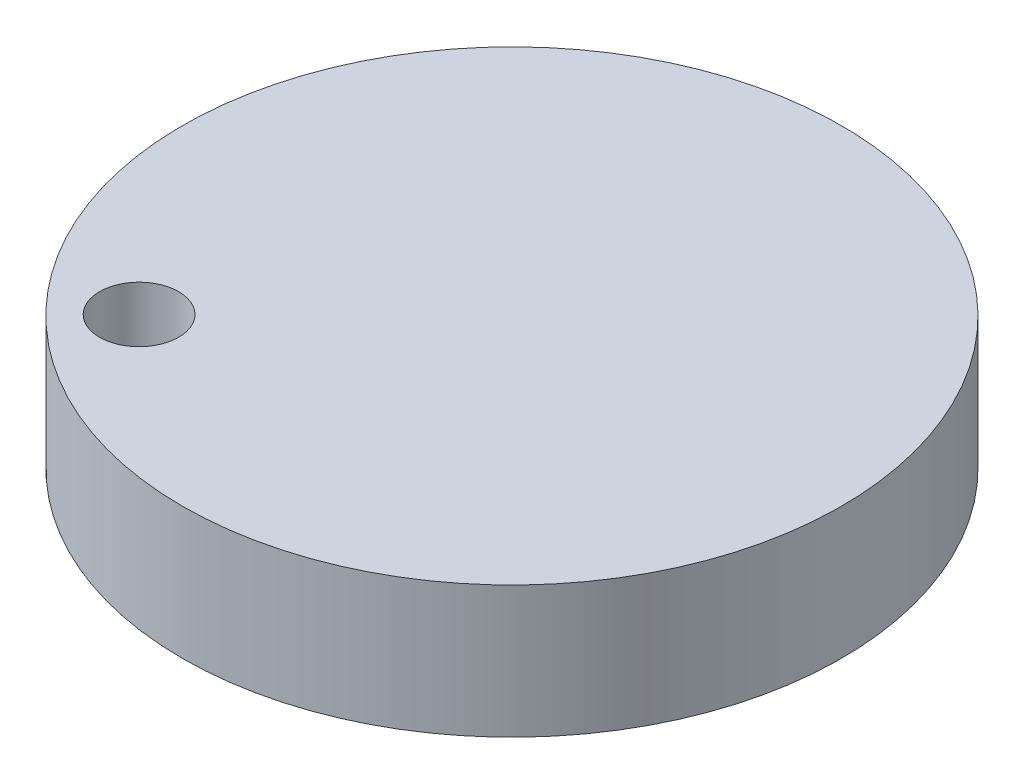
ISO-10303-21;
HEADER;
FILE_DESCRIPTION(('STEP AP214'),'2;1');
FILE_NAME('part.step','',(''),(''),'','','');
FILE_SCHEMA(('AUTOMOTIVE_DESIGN { 1 0 10303 214 1 1 1 1 }'));
ENDSEC;
DATA;
#1=APPLICATION_CONTEXT('core data for automotive mechanical design processes');
#2=APPLICATION_PROTOCOL_DEFINITION('international standard','automotive_design',2000,#1);
#3=PRODUCT_CONTEXT('',#1,'mechanical');
#4=PRODUCT('Part','Part','',(#3));
#5=PRODUCT_RELATED_PRODUCT_CATEGORY('part','',(#4));
#6=PRODUCT_DEFINITION_FORMATION('','',#4);
#7=PRODUCT_DEFINITION_CONTEXT('part definition',#1,'design');
#8=PRODUCT_DEFINITION('design','',#6,#7);
#9=PRODUCT_DEFINITION_SHAPE('','',#8);
#10=(LENGTH_UNIT() NAMED_UNIT(*) SI_UNIT(.MILLI.,.METRE.));
#11=(NAMED_UNIT(*) PLANE_ANGLE_UNIT() SI_UNIT($,.RADIAN.));
#12=(NAMED_UNIT(*) SI_UNIT($,.STERADIAN.) SOLID_ANGLE_UNIT());
#13=UNCERTAINTY_MEASURE_WITH_UNIT(LENGTH_MEASURE(1.E-05),#10,'distance_accuracy_value','');
#14=(GEOMETRIC_REPRESENTATION_CONTEXT(3) GLOBAL_UNCERTAINTY_ASSIGNED_CONTEXT((#13)) GLOBAL_UNIT_ASSIGNED_CONTEXT((#10,
#11,#12)) REPRESENTATION_CONTEXT('',''));
#15=CARTESIAN_POINT('',(0.,0.,0.));
#16=DIRECTION('',(0.,0.,1.));
#17=DIRECTION('',(1.,0.,0.));
#18=AXIS2_PLACEMENT_3D('',#15,#16,#17);
#19=CARTESIAN_POINT('',(0.,5.,0.));
#20=DIRECTION('',(0.,-1.,0.));
#21=DIRECTION('',(0.,0.,-1.));
#22=AXIS2_PLACEMENT_3D('',#19,#20,#21);
#23=CYLINDRICAL_SURFACE('',#22,12.5);
#24=CARTESIAN_POINT('',(0.,5.,0.));
#25=DIRECTION('',(0.,1.,0.));
#26=DIRECTION('',(0.,0.,1.));
#27=AXIS2_PLACEMENT_3D('',#24,#25,#26);
#28=CIRCLE('',#27,12.5);
#29=CARTESIAN_POINT('',(0.,5.,12.5));
#30=VERTEX_POINT('',#29);
#31=EDGE_CURVE('E12',#30,#30,#28,.T.);
#32=ORIENTED_EDGE('',*,*,#31,.F.);
#33=EDGE_LOOP('',(#32));
#34=FACE_BOUND('',#33,.T.);
#35=CARTESIAN_POINT('',(0.,0.,0.));
#36=DIRECTION('',(0.,1.,0.));
#37=DIRECTION('',(0.,0.,1.));
#38=AXIS2_PLACEMENT_3D('',#35,#36,#37);
#39=CIRCLE('',#38,12.5);
#40=CARTESIAN_POINT('',(0.,0.,12.5));
#41=VERTEX_POINT('',#40);
#42=EDGE_CURVE('E167',#41,#41,#39,.T.);
#43=ORIENTED_EDGE('',*,*,#42,.T.);
#44=EDGE_LOOP('',(#43));
#45=FACE_BOUND('',#44,.T.);
#46=ADVANCED_FACE('F159',(#34,#45),#23,.T.);
#47=CARTESIAN_POINT('',(0.,5.,0.));
#48=DIRECTION('',(0.,1.,0.));
#49=DIRECTION('',(0.,0.,1.));
#50=AXIS2_PLACEMENT_3D('',#47,#48,#49);
#51=PLANE('',#50);
#52=CARTESIAN_POINT('',(-7.11915708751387,5.,7.02264924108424));
#53=DIRECTION('',(0.,-1.,0.));
#54=DIRECTION('',(0.,0.,-1.));
#55=AXIS2_PLACEMENT_3D('',#52,#53,#54);
#56=CIRCLE('',#55,1.5);
#57=CARTESIAN_POINT('',(-7.11915708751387,5.,5.52264924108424));
#58=VERTEX_POINT('',#57);
#59=EDGE_CURVE('E357',#58,#58,#56,.T.);
#60=ORIENTED_EDGE('',*,*,#59,.T.);
#61=EDGE_LOOP('',(#60));
#62=FACE_BOUND('',#61,.T.);
#63=ORIENTED_EDGE('',*,*,#31,.T.);
#64=EDGE_LOOP('',(#63));
#65=FACE_BOUND('',#64,.T.);
#66=ADVANCED_FACE('F543',(#62,#65),#51,.T.);
#67=CARTESIAN_POINT('',(0.,0.,0.));
#68=DIRECTION('',(0.,1.,0.));
#69=DIRECTION('',(0.,0.,1.));
#70=AXIS2_PLACEMENT_3D('',#67,#68,#69);
#71=PLANE('',#70);
#72=CARTESIAN_POINT('',(-7.11915708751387,0.,7.02264924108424));
#73=DIRECTION('',(0.,1.,0.));
#74=DIRECTION('',(0.,0.,1.));
#75=AXIS2_PLACEMENT_3D('',#72,#73,#74);
#76=CIRCLE('',#75,1.5);
#77=CARTESIAN_POINT('',(-7.11915708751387,0.,8.52264924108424));
#78=VERTEX_POINT('',#77);
#79=EDGE_CURVE('E162',#78,#78,#76,.T.);
#80=ORIENTED_EDGE('',*,*,#79,.T.);
#81=EDGE_LOOP('',(#80));
#82=FACE_BOUND('',#81,.T.);
#83=DIRECTION('',(-0.365433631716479,0.,-0.93083739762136));
#84=VECTOR('',#83,1.);
#85=CARTESIAN_POINT('',(-3.84697849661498,0.,1.51026949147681));
#86=LINE('',#85,#84);
#87=CARTESIAN_POINT('',(-0.950626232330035,0.,8.88789642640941));
#88=VERTEX_POINT('',#87);
#89=CARTESIAN_POINT('',(-5.20694869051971,0.,-1.95386463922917));
#90=VERTEX_POINT('',#89);
#91=EDGE_CURVE('E402',#88,#90,#86,.T.);
#92=ORIENTED_EDGE('',*,*,#91,.F.);
#93=CARTESIAN_POINT('',(-1.4866757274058,0.,2.65930278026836));
#94=DIRECTION('',(0.,-1.,0.));
#95=DIRECTION('',(0.,0.,-1.));
#96=AXIS2_PLACEMENT_3D('',#93,#94,#95);
#97=CIRCLE('',#96,6.25161802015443);
#98=CARTESIAN_POINT('',(-7.72804018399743,0.,2.30139554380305));
#99=VERTEX_POINT('',#98);
#100=EDGE_CURVE('E400',#88,#99,#97,.F.);
#101=ORIENTED_EDGE('',*,*,#100,.T.);
#102=CARTESIAN_POINT('',(-1.77371629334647,0.,2.95466336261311));
#103=DIRECTION('',(0.,-1.,0.));
#104=DIRECTION('',(0.,0.,-1.));
#105=AXIS2_PLACEMENT_3D('',#102,#103,#104);
#106=CIRCLE('',#105,5.99005274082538);
#107=EDGE_CURVE('E369',#90,#99,#106,.F.);
#108=ORIENTED_EDGE('',*,*,#107,.F.);
#109=EDGE_LOOP('',(#92,#101,#108));
#110=FACE_BOUND('',#109,.T.);
#111=CARTESIAN_POINT('',(-0.842610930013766,0.,2.13445317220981));
#112=DIRECTION('',(0.,-1.,0.));
#113=DIRECTION('',(0.,0.,-1.));
#114=AXIS2_PLACEMENT_3D('',#111,#112,#113);
#115=CIRCLE('',#114,7.17483581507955);
#116=CARTESIAN_POINT('',(0.151933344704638,0.,9.2400249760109));
#117=VERTEX_POINT('',#116);
#118=CARTESIAN_POINT('',(-7.72804018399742,0.,0.117243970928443));
#119=VERTEX_POINT('',#118);
#120=EDGE_CURVE('E462',#117,#119,#115,.F.);
#121=ORIENTED_EDGE('',*,*,#120,.F.);
#122=CARTESIAN_POINT('',(0.783534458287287,0.,0.729839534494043));
#123=DIRECTION('',(0.,-1.,0.));
#124=DIRECTION('',(0.,0.,-1.));
#125=AXIS2_PLACEMENT_3D('',#122,#123,#124);
#126=CIRCLE('',#125,8.53359105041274);
#127=CARTESIAN_POINT('',(6.33222488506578,0.,-5.75354004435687));
#128=VERTEX_POINT('',#127);
#129=EDGE_CURVE('E415',#117,#128,#126,.F.);
#130=ORIENTED_EDGE('',*,*,#129,.T.);
#131=DIRECTION('',(-0.842101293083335,0.,0.539319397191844));
#132=VECTOR('',#131,1.);
#133=CARTESIAN_POINT('',(-0.771211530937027,0.,-1.20418110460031));
#134=LINE('',#133,#132);
#135=CARTESIAN_POINT('',(8.83526426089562,0.,-7.3565986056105));
#136=VERTEX_POINT('',#135);
#137=EDGE_CURVE('E436',#136,#128,#134,.T.);
#138=ORIENTED_EDGE('',*,*,#137,.F.);
#139=DIRECTION('',(0.,0.,1.));
#140=VECTOR('',#139,1.);
#141=CARTESIAN_POINT('',(8.83526426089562,0.,0.));
#142=LINE('',#141,#140);
#143=CARTESIAN_POINT('',(8.83526426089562,0.,-7.80361311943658));
#144=VERTEX_POINT('',#143);
#145=EDGE_CURVE('E491',#144,#136,#142,.T.);
#146=ORIENTED_EDGE('',*,*,#145,.F.);
#147=DIRECTION('',(1.,0.,0.));
#148=VECTOR('',#147,1.);
#149=CARTESIAN_POINT('',(0.,0.,-7.80361311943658));
#150=LINE('',#149,#148);
#151=CARTESIAN_POINT('',(4.39823128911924,0.,-7.80361311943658));
#152=VERTEX_POINT('',#151);
#153=EDGE_CURVE('E488',#152,#144,#150,.T.);
#154=ORIENTED_EDGE('',*,*,#153,.F.);
#155=DIRECTION('',(-0.205904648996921,0.,-0.978572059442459));
#156=VECTOR('',#155,1.);
#157=CARTESIAN_POINT('',(5.7841304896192,0.,-1.21705841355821));
#158=LINE('',#157,#156);
#159=CARTESIAN_POINT('',(4.58634695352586,0.,-6.90958409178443));
#160=VERTEX_POINT('',#159);
#161=EDGE_CURVE('E485',#160,#152,#158,.T.);
#162=ORIENTED_EDGE('',*,*,#161,.F.);
#163=CARTESIAN_POINT('',(-3.65651739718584,0.,-6.55769199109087));
#164=VERTEX_POINT('',#163);
#165=EDGE_CURVE('E463',#160,#164,#126,.F.);
#166=ORIENTED_EDGE('',*,*,#165,.T.);
#167=DIRECTION('',(0.110212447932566,0.,0.993908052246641));
#168=VECTOR('',#167,1.);
#169=CARTESIAN_POINT('',(-2.89376607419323,0.,0.32088385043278));
#170=LINE('',#169,#168);
#171=CARTESIAN_POINT('',(-3.7830585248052,0.,-7.69885388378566));
#172=VERTEX_POINT('',#171);
#173=EDGE_CURVE('E482',#172,#164,#170,.T.);
#174=ORIENTED_EDGE('',*,*,#173,.F.);
#175=DIRECTION('',(0.,0.,1.));
#176=VECTOR('',#175,1.);
#177=CARTESIAN_POINT('',(-3.7830585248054,0.,0.));
#178=LINE('',#177,#176);
#179=CARTESIAN_POINT('',(-3.78305852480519,0.,-7.93892706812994));
#180=VERTEX_POINT('',#179);
#181=EDGE_CURVE('E479',#180,#172,#178,.T.);
#182=ORIENTED_EDGE('',*,*,#181,.F.);
#183=DIRECTION('',(1.,0.,0.));
#184=VECTOR('',#183,1.);
#185=CARTESIAN_POINT('',(0.,0.,-7.93892706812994));
#186=LINE('',#185,#184);
#187=CARTESIAN_POINT('',(-9.12138739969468,0.,-7.93892706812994));
#188=VERTEX_POINT('',#187);
#189=EDGE_CURVE('E476',#188,#180,#186,.T.);
#190=ORIENTED_EDGE('',*,*,#189,.F.);
#191=DIRECTION('',(0.,0.,-1.));
#192=VECTOR('',#191,1.);
#193=CARTESIAN_POINT('',(-9.12138739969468,0.,0.));
#194=LINE('',#193,#192);
#195=CARTESIAN_POINT('',(-9.12138739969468,0.,-7.45839873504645));
#196=VERTEX_POINT('',#195);
#197=EDGE_CURVE('E473',#196,#188,#194,.T.);
#198=ORIENTED_EDGE('',*,*,#197,.F.);
#199=DIRECTION('',(-0.793878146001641,0.,-0.60807687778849));
#200=VECTOR('',#199,1.);
#201=CARTESIAN_POINT('',(0.227758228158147,0.,-0.29735102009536));
#202=LINE('',#201,#200);
#203=CARTESIAN_POINT('',(-6.61395636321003,0.,-5.53781326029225));
#204=VERTEX_POINT('',#203);
#205=EDGE_CURVE('E470',#204,#196,#202,.T.);
#206=ORIENTED_EDGE('',*,*,#205,.F.);
#207=DIRECTION('',(-0.365433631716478,0.,-0.93083739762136));
#208=VECTOR('',#207,1.);
#209=CARTESIAN_POINT('',(-3.84697849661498,0.,1.51026949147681));
#210=LINE('',#209,#208);
#211=CARTESIAN_POINT('',(-6.12175120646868,0.,-4.28406175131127));
#212=VERTEX_POINT('',#211);
#213=EDGE_CURVE('E467',#212,#204,#210,.T.);
#214=ORIENTED_EDGE('',*,*,#213,.F.);
#215=EDGE_CURVE('E464',#212,#119,#126,.F.);
#216=ORIENTED_EDGE('',*,*,#215,.T.);
#217=EDGE_LOOP('',(#121,#130,#138,#146,#154,#162,#166,#174,#182,#190,#198,#206,#214,#216));
#218=FACE_BOUND('',#217,.T.);
#219=ORIENTED_EDGE('',*,*,#42,.F.);
#220=EDGE_LOOP('',(#219));
#221=FACE_BOUND('',#220,.T.);
#222=ADVANCED_FACE('F540',(#82,#110,#218,#221),#71,.F.);
#223=CARTESIAN_POINT('',(0.783534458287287,-2.,0.729839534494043));
#224=DIRECTION('',(0.,1.,0.));
#225=DIRECTION('',(0.,0.,1.));
#226=AXIS2_PLACEMENT_3D('',#223,#224,#225);
#227=CYLINDRICAL_SURFACE('',#226,8.53359105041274);
#228=ORIENTED_EDGE('',*,*,#129,.F.);
#229=DIRECTION('',(0.,1.,0.));
#230=VECTOR('',#229,1.);
#231=CARTESIAN_POINT('',(0.151933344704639,-2.,9.2400249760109));
#232=LINE('',#231,#230);
#233=CARTESIAN_POINT('',(0.151933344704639,-2.,9.2400249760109));
#234=VERTEX_POINT('',#233);
#235=EDGE_CURVE('E534',#234,#117,#232,.T.);
#236=ORIENTED_EDGE('',*,*,#235,.F.);
#237=CARTESIAN_POINT('',(0.783534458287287,-2.,0.729839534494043));
#238=DIRECTION('',(0.,-1.,0.));
#239=DIRECTION('',(0.,0.,-1.));
#240=AXIS2_PLACEMENT_3D('',#237,#238,#239);
#241=CIRCLE('',#240,8.53359105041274);
#242=CARTESIAN_POINT('',(6.33222488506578,-2.,-5.75354004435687));
#243=VERTEX_POINT('',#242);
#244=EDGE_CURVE('E432',#234,#243,#241,.F.);
#245=ORIENTED_EDGE('',*,*,#244,.T.);
#246=DIRECTION('',(0.,1.,0.));
#247=VECTOR('',#246,1.);
#248=CARTESIAN_POINT('',(6.33222488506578,-2.,-5.75354004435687));
#249=LINE('',#248,#247);
#250=EDGE_CURVE('E460',#243,#128,#249,.T.);
#251=ORIENTED_EDGE('',*,*,#250,.T.);
#252=EDGE_LOOP('',(#228,#236,#245,#251));
#253=FACE_BOUND('',#252,.T.);
#254=ADVANCED_FACE('F542',(#253),#227,.T.);
#255=CARTESIAN_POINT('',(-0.842610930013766,-2.,2.13445317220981));
#256=DIRECTION('',(0.,1.,0.));
#257=DIRECTION('',(0.,0.,1.));
#258=AXIS2_PLACEMENT_3D('',#255,#256,#257);
#259=CYLINDRICAL_SURFACE('',#258,7.17483581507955);
#260=ORIENTED_EDGE('',*,*,#120,.T.);
#261=DIRECTION('',(0.,1.,0.));
#262=VECTOR('',#261,1.);
#263=CARTESIAN_POINT('',(-7.72804018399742,-2.,0.117243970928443));
#264=LINE('',#263,#262);
#265=CARTESIAN_POINT('',(-7.72804018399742,-2.,0.117243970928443));
#266=VERTEX_POINT('',#265);
#267=EDGE_CURVE('E531',#266,#119,#264,.T.);
#268=ORIENTED_EDGE('',*,*,#267,.F.);
#269=CARTESIAN_POINT('',(-0.842610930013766,-2.,2.13445317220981));
#270=DIRECTION('',(0.,-1.,0.));
#271=DIRECTION('',(0.,0.,-1.));
#272=AXIS2_PLACEMENT_3D('',#269,#270,#271);
#273=CIRCLE('',#272,7.17483581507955);
#274=EDGE_CURVE('E435',#234,#266,#273,.F.);
#275=ORIENTED_EDGE('',*,*,#274,.F.);
#276=ORIENTED_EDGE('',*,*,#235,.T.);
#277=EDGE_LOOP('',(#260,#268,#275,#276));
#278=FACE_BOUND('',#277,.T.);
#279=ADVANCED_FACE('F551',(#278),#259,.F.);
#280=ORIENTED_EDGE('',*,*,#215,.F.);
#281=DIRECTION('',(0.,1.,0.));
#282=VECTOR('',#281,1.);
#283=CARTESIAN_POINT('',(-6.12175120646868,-2.,-4.28406175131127));
#284=LINE('',#283,#282);
#285=CARTESIAN_POINT('',(-6.12175120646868,-2.,-4.28406175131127));
#286=VERTEX_POINT('',#285);
#287=EDGE_CURVE('E528',#286,#212,#284,.T.);
#288=ORIENTED_EDGE('',*,*,#287,.F.);
#289=EDGE_CURVE('E438',#286,#266,#241,.F.);
#290=ORIENTED_EDGE('',*,*,#289,.T.);
#291=ORIENTED_EDGE('',*,*,#267,.T.);
#292=EDGE_LOOP('',(#280,#288,#290,#291));
#293=FACE_BOUND('',#292,.T.);
#294=ADVANCED_FACE('F554',(#293),#227,.T.);
#295=CARTESIAN_POINT('',(-3.84697849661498,-2.,1.51026949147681));
#296=DIRECTION('',(0.93083739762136,0.,-0.365433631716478));
#297=DIRECTION('',(-0.365433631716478,0.,-0.93083739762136));
#298=AXIS2_PLACEMENT_3D('',#295,#296,#297);
#299=PLANE('',#298);
#300=ORIENTED_EDGE('',*,*,#213,.T.);
#301=DIRECTION('',(0.,1.,0.));
#302=VECTOR('',#301,1.);
#303=CARTESIAN_POINT('',(-6.61395636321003,-2.,-5.53781326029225));
#304=LINE('',#303,#302);
#305=CARTESIAN_POINT('',(-6.61395636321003,-2.,-5.53781326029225));
#306=VERTEX_POINT('',#305);
#307=EDGE_CURVE('E525',#306,#204,#304,.T.);
#308=ORIENTED_EDGE('',*,*,#307,.F.);
#309=DIRECTION('',(-0.365433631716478,0.,-0.93083739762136));
#310=VECTOR('',#309,1.);
#311=CARTESIAN_POINT('',(-3.84697849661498,-2.,1.51026949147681));
#312=LINE('',#311,#310);
#313=EDGE_CURVE('E440',#286,#306,#312,.T.);
#314=ORIENTED_EDGE('',*,*,#313,.F.);
#315=ORIENTED_EDGE('',*,*,#287,.T.);
#316=EDGE_LOOP('',(#300,#308,#314,#315));
#317=FACE_BOUND('',#316,.T.);
#318=ADVANCED_FACE('F791',(#317),#299,.F.);
#319=CARTESIAN_POINT('',(0.227758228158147,-2.,-0.29735102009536));
#320=DIRECTION('',(0.60807687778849,0.,-0.793878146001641));
#321=DIRECTION('',(-0.793878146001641,0.,-0.60807687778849));
#322=AXIS2_PLACEMENT_3D('',#319,#320,#321);
#323=PLANE('',#322);
#324=ORIENTED_EDGE('',*,*,#205,.T.);
#325=DIRECTION('',(0.,1.,0.));
#326=VECTOR('',#325,1.);
#327=CARTESIAN_POINT('',(-9.12138739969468,-2.,-7.45839873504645));
#328=LINE('',#327,#326);
#329=CARTESIAN_POINT('',(-9.12138739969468,-2.,-7.45839873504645));
#330=VERTEX_POINT('',#329);
#331=EDGE_CURVE('E522',#330,#196,#328,.T.);
#332=ORIENTED_EDGE('',*,*,#331,.F.);
#333=DIRECTION('',(-0.793878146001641,0.,-0.60807687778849));
#334=VECTOR('',#333,1.);
#335=CARTESIAN_POINT('',(0.227758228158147,-2.,-0.29735102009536));
#336=LINE('',#335,#334);
#337=EDGE_CURVE('E442',#306,#330,#336,.T.);
#338=ORIENTED_EDGE('',*,*,#337,.F.);
#339=ORIENTED_EDGE('',*,*,#307,.T.);
#340=EDGE_LOOP('',(#324,#332,#338,#339));
#341=FACE_BOUND('',#340,.T.);
#342=ADVANCED_FACE('F783',(#341),#323,.F.);
#343=CARTESIAN_POINT('',(-9.12138739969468,-2.,0.));
#344=DIRECTION('',(1.,0.,0.));
#345=DIRECTION('',(0.,0.,-1.));
#346=AXIS2_PLACEMENT_3D('',#343,#344,#345);
#347=PLANE('',#346);
#348=ORIENTED_EDGE('',*,*,#197,.T.);
#349=DIRECTION('',(0.,1.,0.));
#350=VECTOR('',#349,1.);
#351=CARTESIAN_POINT('',(-9.12138739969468,-2.,-7.93892706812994));
#352=LINE('',#351,#350);
#353=CARTESIAN_POINT('',(-9.12138739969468,-2.,-7.93892706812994));
#354=VERTEX_POINT('',#353);
#355=EDGE_CURVE('E519',#354,#188,#352,.T.);
#356=ORIENTED_EDGE('',*,*,#355,.F.);
#357=DIRECTION('',(0.,0.,-1.));
#358=VECTOR('',#357,1.);
#359=CARTESIAN_POINT('',(-9.12138739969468,-2.,0.));
#360=LINE('',#359,#358);
#361=EDGE_CURVE('E444',#330,#354,#360,.T.);
#362=ORIENTED_EDGE('',*,*,#361,.F.);
#363=ORIENTED_EDGE('',*,*,#331,.T.);
#364=EDGE_LOOP('',(#348,#356,#362,#363));
#365=FACE_BOUND('',#364,.T.);
#366=ADVANCED_FACE('F775',(#365),#347,.F.);
#367=CARTESIAN_POINT('',(0.,-2.,-7.93892706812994));
#368=DIRECTION('',(0.,0.,1.));
#369=DIRECTION('',(1.,0.,0.));
#370=AXIS2_PLACEMENT_3D('',#367,#368,#369);
#371=PLANE('',#370);
#372=ORIENTED_EDGE('',*,*,#189,.T.);
#373=DIRECTION('',(0.,1.,0.));
#374=VECTOR('',#373,1.);
#375=CARTESIAN_POINT('',(-3.78305852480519,-2.,-7.93892706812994));
#376=LINE('',#375,#374);
#377=CARTESIAN_POINT('',(-3.78305852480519,-2.,-7.93892706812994));
#378=VERTEX_POINT('',#377);
#379=EDGE_CURVE('E516',#378,#180,#376,.T.);
#380=ORIENTED_EDGE('',*,*,#379,.F.);
#381=DIRECTION('',(1.,0.,0.));
#382=VECTOR('',#381,1.);
#383=CARTESIAN_POINT('',(0.,-2.,-7.93892706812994));
#384=LINE('',#383,#382);
#385=EDGE_CURVE('E446',#354,#378,#384,.T.);
#386=ORIENTED_EDGE('',*,*,#385,.F.);
#387=ORIENTED_EDGE('',*,*,#355,.T.);
#388=EDGE_LOOP('',(#372,#380,#386,#387));
#389=FACE_BOUND('',#388,.T.);
#390=ADVANCED_FACE('F767',(#389),#371,.F.);
#391=CARTESIAN_POINT('',(-3.7830585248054,-2.,0.));
#392=DIRECTION('',(-1.,0.,0.));
#393=DIRECTION('',(0.,0.,1.));
#394=AXIS2_PLACEMENT_3D('',#391,#392,#393);
#395=PLANE('',#394);
#396=ORIENTED_EDGE('',*,*,#181,.T.);
#397=DIRECTION('',(0.,1.,0.));
#398=VECTOR('',#397,1.);
#399=CARTESIAN_POINT('',(-3.7830585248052,-2.,-7.69885388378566));
#400=LINE('',#399,#398);
#401=CARTESIAN_POINT('',(-3.7830585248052,-2.,-7.69885388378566));
#402=VERTEX_POINT('',#401);
#403=EDGE_CURVE('E513',#402,#172,#400,.T.);
#404=ORIENTED_EDGE('',*,*,#403,.F.);
#405=DIRECTION('',(0.,0.,1.));
#406=VECTOR('',#405,1.);
#407=CARTESIAN_POINT('',(-3.7830585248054,-2.,0.));
#408=LINE('',#407,#406);
#409=EDGE_CURVE('E448',#378,#402,#408,.T.);
#410=ORIENTED_EDGE('',*,*,#409,.F.);
#411=ORIENTED_EDGE('',*,*,#379,.T.);
#412=EDGE_LOOP('',(#396,#404,#410,#411));
#413=FACE_BOUND('',#412,.T.);
#414=ADVANCED_FACE('F759',(#413),#395,.F.);
#415=CARTESIAN_POINT('',(-2.89376607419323,-2.,0.32088385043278));
#416=DIRECTION('',(-0.993908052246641,0.,0.110212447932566));
#417=DIRECTION('',(0.110212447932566,0.,0.993908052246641));
#418=AXIS2_PLACEMENT_3D('',#415,#416,#417);
#419=PLANE('',#418);
#420=ORIENTED_EDGE('',*,*,#173,.T.);
#421=DIRECTION('',(0.,1.,0.));
#422=VECTOR('',#421,1.);
#423=CARTESIAN_POINT('',(-3.65651739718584,-2.,-6.55769199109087));
#424=LINE('',#423,#422);
#425=CARTESIAN_POINT('',(-3.65651739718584,-2.,-6.55769199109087));
#426=VERTEX_POINT('',#425);
#427=EDGE_CURVE('E510',#426,#164,#424,.T.);
#428=ORIENTED_EDGE('',*,*,#427,.F.);
#429=DIRECTION('',(0.110212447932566,0.,0.993908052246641));
#430=VECTOR('',#429,1.);
#431=CARTESIAN_POINT('',(-2.89376607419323,-2.,0.32088385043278));
#432=LINE('',#431,#430);
#433=EDGE_CURVE('E450',#402,#426,#432,.T.);
#434=ORIENTED_EDGE('',*,*,#433,.F.);
#435=ORIENTED_EDGE('',*,*,#403,.T.);
#436=EDGE_LOOP('',(#420,#428,#434,#435));
#437=FACE_BOUND('',#436,.T.);
#438=ADVANCED_FACE('F752',(#437),#419,.F.);
#439=ORIENTED_EDGE('',*,*,#165,.F.);
#440=DIRECTION('',(0.,1.,0.));
#441=VECTOR('',#440,1.);
#442=CARTESIAN_POINT('',(4.58634695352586,-2.,-6.90958409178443));
#443=LINE('',#442,#441);
#444=CARTESIAN_POINT('',(4.58634695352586,-2.,-6.90958409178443));
#445=VERTEX_POINT('',#444);
#446=EDGE_CURVE('E507',#445,#160,#443,.T.);
#447=ORIENTED_EDGE('',*,*,#446,.F.);
#448=EDGE_CURVE('E437',#445,#426,#241,.F.);
#449=ORIENTED_EDGE('',*,*,#448,.T.);
#450=ORIENTED_EDGE('',*,*,#427,.T.);
#451=EDGE_LOOP('',(#439,#447,#449,#450));
#452=FACE_BOUND('',#451,.T.);
#453=ADVANCED_FACE('F555',(#452),#227,.T.);
#454=CARTESIAN_POINT('',(5.7841304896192,-2.,-1.21705841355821));
#455=DIRECTION('',(0.978572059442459,0.,-0.205904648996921));
#456=DIRECTION('',(-0.205904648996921,0.,-0.978572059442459));
#457=AXIS2_PLACEMENT_3D('',#454,#455,#456);
#458=PLANE('',#457);
#459=ORIENTED_EDGE('',*,*,#161,.T.);
#460=DIRECTION('',(0.,1.,0.));
#461=VECTOR('',#460,1.);
#462=CARTESIAN_POINT('',(4.39823128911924,-2.,-7.80361311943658));
#463=LINE('',#462,#461);
#464=CARTESIAN_POINT('',(4.39823128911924,-2.,-7.80361311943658));
#465=VERTEX_POINT('',#464);
#466=EDGE_CURVE('E504',#465,#152,#463,.T.);
#467=ORIENTED_EDGE('',*,*,#466,.F.);
#468=DIRECTION('',(-0.205904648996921,0.,-0.978572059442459));
#469=VECTOR('',#468,1.);
#470=CARTESIAN_POINT('',(5.7841304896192,-2.,-1.21705841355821));
#471=LINE('',#470,#469);
#472=EDGE_CURVE('E452',#445,#465,#471,.T.);
#473=ORIENTED_EDGE('',*,*,#472,.F.);
#474=ORIENTED_EDGE('',*,*,#446,.T.);
#475=EDGE_LOOP('',(#459,#467,#473,#474));
#476=FACE_BOUND('',#475,.T.);
#477=ADVANCED_FACE('F737',(#476),#458,.F.);
#478=CARTESIAN_POINT('',(0.,-2.,-7.80361311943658));
#479=DIRECTION('',(0.,0.,1.));
#480=DIRECTION('',(1.,0.,0.));
#481=AXIS2_PLACEMENT_3D('',#478,#479,#480);
#482=PLANE('',#481);
#483=ORIENTED_EDGE('',*,*,#153,.T.);
#484=DIRECTION('',(0.,1.,0.));
#485=VECTOR('',#484,1.);
#486=CARTESIAN_POINT('',(8.83526426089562,-2.,-7.80361311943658));
#487=LINE('',#486,#485);
#488=CARTESIAN_POINT('',(8.83526426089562,-2.,-7.80361311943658));
#489=VERTEX_POINT('',#488);
#490=EDGE_CURVE('E501',#489,#144,#487,.T.);
#491=ORIENTED_EDGE('',*,*,#490,.F.);
#492=DIRECTION('',(1.,0.,0.));
#493=VECTOR('',#492,1.);
#494=CARTESIAN_POINT('',(0.,-2.,-7.80361311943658));
#495=LINE('',#494,#493);
#496=EDGE_CURVE('E454',#465,#489,#495,.T.);
#497=ORIENTED_EDGE('',*,*,#496,.F.);
#498=ORIENTED_EDGE('',*,*,#466,.T.);
#499=EDGE_LOOP('',(#483,#491,#497,#498));
#500=FACE_BOUND('',#499,.T.);
#501=ADVANCED_FACE('F729',(#500),#482,.F.);
#502=CARTESIAN_POINT('',(8.83526426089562,-2.,0.));
#503=DIRECTION('',(-1.,0.,0.));
#504=DIRECTION('',(0.,0.,1.));
#505=AXIS2_PLACEMENT_3D('',#502,#503,#504);
#506=PLANE('',#505);
#507=ORIENTED_EDGE('',*,*,#145,.T.);
#508=DIRECTION('',(0.,1.,0.));
#509=VECTOR('',#508,1.);
#510=CARTESIAN_POINT('',(8.83526426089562,-2.,-7.3565986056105));
#511=LINE('',#510,#509);
#512=CARTESIAN_POINT('',(8.83526426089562,-2.,-7.3565986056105));
#513=VERTEX_POINT('',#512);
#514=EDGE_CURVE('E498',#513,#136,#511,.T.);
#515=ORIENTED_EDGE('',*,*,#514,.F.);
#516=DIRECTION('',(0.,0.,1.));
#517=VECTOR('',#516,1.);
#518=CARTESIAN_POINT('',(8.83526426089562,-2.,0.));
#519=LINE('',#518,#517);
#520=EDGE_CURVE('E456',#489,#513,#519,.T.);
#521=ORIENTED_EDGE('',*,*,#520,.F.);
#522=ORIENTED_EDGE('',*,*,#490,.T.);
#523=EDGE_LOOP('',(#507,#515,#521,#522));
#524=FACE_BOUND('',#523,.T.);
#525=ADVANCED_FACE('F721',(#524),#506,.F.);
#526=CARTESIAN_POINT('',(-0.771211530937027,-2.,-1.20418110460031));
#527=DIRECTION('',(-0.539319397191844,0.,-0.842101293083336));
#528=DIRECTION('',(-0.842101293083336,0.,0.539319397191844));
#529=AXIS2_PLACEMENT_3D('',#526,#527,#528);
#530=PLANE('',#529);
#531=ORIENTED_EDGE('',*,*,#137,.T.);
#532=ORIENTED_EDGE('',*,*,#250,.F.);
#533=DIRECTION('',(-0.842101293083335,0.,0.539319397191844));
#534=VECTOR('',#533,1.);
#535=CARTESIAN_POINT('',(-0.771211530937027,-2.,-1.20418110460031));
#536=LINE('',#535,#534);
#537=EDGE_CURVE('E458',#513,#243,#536,.T.);
#538=ORIENTED_EDGE('',*,*,#537,.F.);
#539=ORIENTED_EDGE('',*,*,#514,.T.);
#540=EDGE_LOOP('',(#531,#532,#538,#539));
#541=FACE_BOUND('',#540,.T.);
#542=ADVANCED_FACE('F713',(#541),#530,.F.);
#543=CARTESIAN_POINT('',(0.,-2.,0.));
#544=DIRECTION('',(0.,-1.,0.));
#545=DIRECTION('',(0.,0.,-1.));
#546=AXIS2_PLACEMENT_3D('',#543,#544,#545);
#547=PLANE('',#546);
#548=ORIENTED_EDGE('',*,*,#244,.F.);
#549=ORIENTED_EDGE('',*,*,#274,.T.);
#550=ORIENTED_EDGE('',*,*,#289,.F.);
#551=ORIENTED_EDGE('',*,*,#313,.T.);
#552=ORIENTED_EDGE('',*,*,#337,.T.);
#553=ORIENTED_EDGE('',*,*,#361,.T.);
#554=ORIENTED_EDGE('',*,*,#385,.T.);
#555=ORIENTED_EDGE('',*,*,#409,.T.);
#556=ORIENTED_EDGE('',*,*,#433,.T.);
#557=ORIENTED_EDGE('',*,*,#448,.F.);
#558=ORIENTED_EDGE('',*,*,#472,.T.);
#559=ORIENTED_EDGE('',*,*,#496,.T.);
#560=ORIENTED_EDGE('',*,*,#520,.T.);
#561=ORIENTED_EDGE('',*,*,#537,.T.);
#562=EDGE_LOOP('',(#548,#549,#550,#551,#552,#553,#554,#555,#556,#557,#558,#559,#560,#561));
#563=FACE_BOUND('',#562,.T.);
#564=ADVANCED_FACE('F705',(#563),#547,.T.);
#565=CARTESIAN_POINT('',(-1.4866757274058,-2.,2.65930278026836));
#566=DIRECTION('',(0.,1.,0.));
#567=DIRECTION('',(0.,0.,1.));
#568=AXIS2_PLACEMENT_3D('',#565,#566,#567);
#569=CYLINDRICAL_SURFACE('',#568,6.25161802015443);
#570=ORIENTED_EDGE('',*,*,#100,.F.);
#571=DIRECTION('',(0.,1.,0.));
#572=VECTOR('',#571,1.);
#573=CARTESIAN_POINT('',(-0.950626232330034,-2.,8.88789642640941));
#574=LINE('',#573,#572);
#575=CARTESIAN_POINT('',(-0.950626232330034,-2.,8.88789642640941));
#576=VERTEX_POINT('',#575);
#577=EDGE_CURVE('E412',#576,#88,#574,.T.);
#578=ORIENTED_EDGE('',*,*,#577,.F.);
#579=CARTESIAN_POINT('',(-1.4866757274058,-2.,2.65930278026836));
#580=DIRECTION('',(0.,-1.,0.));
#581=DIRECTION('',(0.,0.,-1.));
#582=AXIS2_PLACEMENT_3D('',#579,#580,#581);
#583=CIRCLE('',#582,6.25161802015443);
#584=CARTESIAN_POINT('',(-7.72804018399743,-2.,2.30139554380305));
#585=VERTEX_POINT('',#584);
#586=EDGE_CURVE('E380',#576,#585,#583,.F.);
#587=ORIENTED_EDGE('',*,*,#586,.T.);
#588=DIRECTION('',(0.,1.,0.));
#589=VECTOR('',#588,1.);
#590=CARTESIAN_POINT('',(-7.72804018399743,-2.,2.30139554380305));
#591=LINE('',#590,#589);
#592=EDGE_CURVE('E405',#585,#99,#591,.T.);
#593=ORIENTED_EDGE('',*,*,#592,.T.);
#594=EDGE_LOOP('',(#570,#578,#587,#593));
#595=FACE_BOUND('',#594,.T.);
#596=ADVANCED_FACE('F697',(#595),#569,.T.);
#597=CARTESIAN_POINT('',(-3.84697849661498,-2.,1.51026949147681));
#598=DIRECTION('',(0.93083739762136,0.,-0.365433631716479));
#599=DIRECTION('',(-0.365433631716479,0.,-0.93083739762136));
#600=AXIS2_PLACEMENT_3D('',#597,#598,#599);
#601=PLANE('',#600);
#602=ORIENTED_EDGE('',*,*,#91,.T.);
#603=DIRECTION('',(0.,1.,0.));
#604=VECTOR('',#603,1.);
#605=CARTESIAN_POINT('',(-5.20694869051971,-2.,-1.95386463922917));
#606=LINE('',#605,#604);
#607=CARTESIAN_POINT('',(-5.20694869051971,-2.,-1.95386463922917));
#608=VERTEX_POINT('',#607);
#609=EDGE_CURVE('E408',#608,#90,#606,.T.);
#610=ORIENTED_EDGE('',*,*,#609,.F.);
#611=DIRECTION('',(-0.365433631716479,0.,-0.93083739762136));
#612=VECTOR('',#611,1.);
#613=CARTESIAN_POINT('',(-3.84697849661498,-2.,1.51026949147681));
#614=LINE('',#613,#612);
#615=EDGE_CURVE('E383',#576,#608,#614,.T.);
#616=ORIENTED_EDGE('',*,*,#615,.F.);
#617=ORIENTED_EDGE('',*,*,#577,.T.);
#618=EDGE_LOOP('',(#602,#610,#616,#617));
#619=FACE_BOUND('',#618,.T.);
#620=ADVANCED_FACE('F689',(#619),#601,.F.);
#621=CARTESIAN_POINT('',(1.86824150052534,-2.,0.669970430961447));
#622=DIRECTION('',(0.941303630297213,0.,0.337561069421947));
#623=DIRECTION('',(0.337561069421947,0.,-0.941303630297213));
#624=AXIS2_PLACEMENT_3D('',#621,#622,#623);
#625=PLANE('',#624);
#626=DIRECTION('',(0.337561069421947,0.,-0.941303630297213));
#627=VECTOR('',#626,1.);
#628=CARTESIAN_POINT('',(1.86824150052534,0.,0.669970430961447));
#629=LINE('',#628,#627);
#630=CARTESIAN_POINT('',(0.0321582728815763,0.,5.78996786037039));
#631=VERTEX_POINT('',#630);
#632=CARTESIAN_POINT('',(2.53950586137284,0.,-1.20187924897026));
#633=VERTEX_POINT('',#632);
#634=EDGE_CURVE('E391',#631,#633,#629,.T.);
#635=ORIENTED_EDGE('',*,*,#634,.T.);
#636=DIRECTION('',(0.,1.,0.));
#637=VECTOR('',#636,1.);
#638=CARTESIAN_POINT('',(2.53950586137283,-2.,-1.20187924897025));
#639=LINE('',#638,#637);
#640=CARTESIAN_POINT('',(2.53950586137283,-2.,-1.20187924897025));
#641=VERTEX_POINT('',#640);
#642=EDGE_CURVE('E409',#641,#633,#639,.T.);
#643=ORIENTED_EDGE('',*,*,#642,.F.);
#644=DIRECTION('',(0.337561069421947,0.,-0.941303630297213));
#645=VECTOR('',#644,1.);
#646=CARTESIAN_POINT('',(1.86824150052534,-2.,0.669970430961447));
#647=LINE('',#646,#645);
#648=CARTESIAN_POINT('',(0.0321582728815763,-2.,5.78996786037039));
#649=VERTEX_POINT('',#648);
#650=EDGE_CURVE('E371',#649,#641,#647,.T.);
#651=ORIENTED_EDGE('',*,*,#650,.F.);
#652=DIRECTION('',(0.,1.,0.));
#653=VECTOR('',#652,1.);
#654=CARTESIAN_POINT('',(0.0321582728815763,-2.,5.78996786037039));
#655=LINE('',#654,#653);
#656=EDGE_CURVE('E416',#649,#631,#655,.T.);
#657=ORIENTED_EDGE('',*,*,#656,.T.);
#658=EDGE_LOOP('',(#635,#643,#651,#657));
#659=FACE_BOUND('',#658,.T.);
#660=ADVANCED_FACE('F682',(#659),#625,.F.);
#661=CARTESIAN_POINT('',(-1.77371629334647,-2.,2.95466336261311));
#662=DIRECTION('',(0.,1.,0.));
#663=DIRECTION('',(0.,0.,1.));
#664=AXIS2_PLACEMENT_3D('',#661,#662,#663);
#665=CYLINDRICAL_SURFACE('',#664,5.99005274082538);
#666=CARTESIAN_POINT('',(-3.24557238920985,0.,-2.8517444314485));
#667=VERTEX_POINT('',#666);
#668=EDGE_CURVE('E183',#633,#667,#106,.F.);
#669=ORIENTED_EDGE('',*,*,#668,.T.);
#670=DIRECTION('',(0.,1.,0.));
#671=VECTOR('',#670,1.);
#672=CARTESIAN_POINT('',(-3.24557238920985,-2.,-2.8517444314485));
#673=LINE('',#672,#671);
#674=CARTESIAN_POINT('',(-3.24557238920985,-2.,-2.8517444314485));
#675=VERTEX_POINT('',#674);
#676=EDGE_CURVE('E423',#675,#667,#673,.T.);
#677=ORIENTED_EDGE('',*,*,#676,.F.);
#678=CARTESIAN_POINT('',(-1.77371629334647,-2.,2.95466336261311));
#679=DIRECTION('',(0.,-1.,0.));
#680=DIRECTION('',(0.,0.,-1.));
#681=AXIS2_PLACEMENT_3D('',#678,#679,#680);
#682=CIRCLE('',#681,5.99005274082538);
#683=EDGE_CURVE('E373',#641,#675,#682,.F.);
#684=ORIENTED_EDGE('',*,*,#683,.F.);
#685=ORIENTED_EDGE('',*,*,#642,.T.);
#686=EDGE_LOOP('',(#669,#677,#684,#685));
#687=FACE_BOUND('',#686,.T.);
#688=ADVANCED_FACE('F646',(#687),#665,.F.);
#689=CARTESIAN_POINT('',(-2.89376607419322,-2.,0.320883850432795));
#690=DIRECTION('',(-0.99390805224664,0.,0.110212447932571));
#691=DIRECTION('',(0.110212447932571,0.,0.99390805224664));
#692=AXIS2_PLACEMENT_3D('',#689,#690,#691);
#693=PLANE('',#692);
#694=DIRECTION('',(0.110212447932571,0.,0.99390805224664));
#695=VECTOR('',#694,1.);
#696=CARTESIAN_POINT('',(-2.89376607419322,0.,0.320883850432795));
#697=LINE('',#696,#695);
#698=CARTESIAN_POINT('',(-3.20034941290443,0.,-2.4439186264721));
#699=VERTEX_POINT('',#698);
#700=EDGE_CURVE('E394',#667,#699,#697,.T.);
#701=ORIENTED_EDGE('',*,*,#700,.T.);
#702=DIRECTION('',(0.,1.,0.));
#703=VECTOR('',#702,1.);
#704=CARTESIAN_POINT('',(-3.20034941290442,-2.,-2.4439186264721));
#705=LINE('',#704,#703);
#706=CARTESIAN_POINT('',(-3.20034941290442,-2.,-2.4439186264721));
#707=VERTEX_POINT('',#706);
#708=EDGE_CURVE('E419',#707,#699,#705,.T.);
#709=ORIENTED_EDGE('',*,*,#708,.F.);
#710=DIRECTION('',(0.110212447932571,0.,0.99390805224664));
#711=VECTOR('',#710,1.);
#712=CARTESIAN_POINT('',(-2.89376607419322,-2.,0.320883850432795));
#713=LINE('',#712,#711);
#714=EDGE_CURVE('E376',#675,#707,#713,.T.);
#715=ORIENTED_EDGE('',*,*,#714,.F.);
#716=ORIENTED_EDGE('',*,*,#676,.T.);
#717=EDGE_LOOP('',(#701,#709,#715,#716));
#718=FACE_BOUND('',#717,.T.);
#719=ADVANCED_FACE('F667',(#718),#693,.F.);
#720=CARTESIAN_POINT('',(3.25776594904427,-2.,1.40010657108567));
#721=DIRECTION('',(-0.918744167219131,0.,-0.394853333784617));
#722=DIRECTION('',(-0.394853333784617,0.,0.918744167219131));
#723=AXIS2_PLACEMENT_3D('',#720,#721,#722);
#724=PLANE('',#723);
#725=DIRECTION('',(-0.394853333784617,0.,0.918744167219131));
#726=VECTOR('',#725,1.);
#727=CARTESIAN_POINT('',(3.25776594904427,0.,1.40010657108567));
#728=LINE('',#727,#726);
#729=CARTESIAN_POINT('',(3.66679962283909,0.,0.448367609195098));
#730=VERTEX_POINT('',#729);
#731=CARTESIAN_POINT('',(0.151933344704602,0.,8.62675339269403));
#732=VERTEX_POINT('',#731);
#733=EDGE_CURVE('E342',#730,#732,#728,.T.);
#734=ORIENTED_EDGE('',*,*,#733,.T.);
#735=DIRECTION('',(0.,1.,0.));
#736=VECTOR('',#735,1.);
#737=CARTESIAN_POINT('',(0.151933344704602,-2.,8.62675339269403));
#738=LINE('',#737,#736);
#739=CARTESIAN_POINT('',(0.151933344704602,-2.,8.62675339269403));
#740=VERTEX_POINT('',#739);
#741=EDGE_CURVE('E420',#740,#732,#738,.T.);
#742=ORIENTED_EDGE('',*,*,#741,.F.);
#743=DIRECTION('',(-0.394853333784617,0.,0.918744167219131));
#744=VECTOR('',#743,1.);
#745=CARTESIAN_POINT('',(3.25776594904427,-2.,1.40010657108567));
#746=LINE('',#745,#744);
#747=CARTESIAN_POINT('',(3.66679962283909,-2.,0.448367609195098));
#748=VERTEX_POINT('',#747);
#749=EDGE_CURVE('E365',#748,#740,#746,.T.);
#750=ORIENTED_EDGE('',*,*,#749,.F.);
#751=DIRECTION('',(0.,1.,0.));
#752=VECTOR('',#751,1.);
#753=CARTESIAN_POINT('',(3.66679962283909,-2.,0.448367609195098));
#754=LINE('',#753,#752);
#755=EDGE_CURVE('E427',#748,#730,#754,.T.);
#756=ORIENTED_EDGE('',*,*,#755,.T.);
#757=EDGE_LOOP('',(#734,#742,#750,#756));
#758=FACE_BOUND('',#757,.T.);
#759=ADVANCED_FACE('F659',(#758),#724,.F.);
#760=CARTESIAN_POINT('',(-1.94164755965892,-2.,0.762263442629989));
#761=DIRECTION('',(-0.93083739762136,0.,0.365433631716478));
#762=DIRECTION('',(0.365433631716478,0.,0.93083739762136));
#763=AXIS2_PLACEMENT_3D('',#760,#761,#762);
#764=PLANE('',#763);
#765=DIRECTION('',(0.365433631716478,0.,0.93083739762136));
#766=VECTOR('',#765,1.);
#767=CARTESIAN_POINT('',(-1.94164755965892,0.,0.762263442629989));
#768=LINE('',#767,#766);
#769=EDGE_CURVE('E397',#699,#631,#768,.T.);
#770=ORIENTED_EDGE('',*,*,#769,.T.);
#771=ORIENTED_EDGE('',*,*,#656,.F.);
#772=DIRECTION('',(0.365433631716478,0.,0.93083739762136));
#773=VECTOR('',#772,1.);
#774=CARTESIAN_POINT('',(-1.94164755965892,-2.,0.762263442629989));
#775=LINE('',#774,#773);
#776=EDGE_CURVE('E378',#707,#649,#775,.T.);
#777=ORIENTED_EDGE('',*,*,#776,.F.);
#778=ORIENTED_EDGE('',*,*,#708,.T.);
#779=EDGE_LOOP('',(#770,#771,#777,#778));
#780=FACE_BOUND('',#779,.T.);
#781=ADVANCED_FACE('F652',(#780),#764,.F.);
#782=EDGE_CURVE('E388',#732,#730,#106,.F.);
#783=ORIENTED_EDGE('',*,*,#782,.T.);
#784=ORIENTED_EDGE('',*,*,#755,.F.);
#785=EDGE_CURVE('E368',#740,#748,#682,.F.);
#786=ORIENTED_EDGE('',*,*,#785,.F.);
#787=ORIENTED_EDGE('',*,*,#741,.T.);
#788=EDGE_LOOP('',(#783,#784,#786,#787));
#789=FACE_BOUND('',#788,.T.);
#790=ADVANCED_FACE('F643',(#789),#665,.F.);
#791=ORIENTED_EDGE('',*,*,#107,.T.);
#792=ORIENTED_EDGE('',*,*,#592,.F.);
#793=EDGE_CURVE('E372',#608,#585,#682,.F.);
#794=ORIENTED_EDGE('',*,*,#793,.F.);
#795=ORIENTED_EDGE('',*,*,#609,.T.);
#796=EDGE_LOOP('',(#791,#792,#794,#795));
#797=FACE_BOUND('',#796,.T.);
#798=ADVANCED_FACE('F635',(#797),#665,.F.);
#799=CARTESIAN_POINT('',(0.,-2.,0.));
#800=DIRECTION('',(0.,-1.,0.));
#801=DIRECTION('',(0.,0.,-1.));
#802=AXIS2_PLACEMENT_3D('',#799,#800,#801);
#803=PLANE('',#802);
#804=ORIENTED_EDGE('',*,*,#749,.T.);
#805=ORIENTED_EDGE('',*,*,#785,.T.);
#806=EDGE_LOOP('',(#804,#805));
#807=FACE_BOUND('',#806,.T.);
#808=ORIENTED_EDGE('',*,*,#650,.T.);
#809=ORIENTED_EDGE('',*,*,#683,.T.);
#810=ORIENTED_EDGE('',*,*,#714,.T.);
#811=ORIENTED_EDGE('',*,*,#776,.T.);
#812=EDGE_LOOP('',(#808,#809,#810,#811));
#813=FACE_BOUND('',#812,.T.);
#814=ORIENTED_EDGE('',*,*,#586,.F.);
#815=ORIENTED_EDGE('',*,*,#615,.T.);
#816=ORIENTED_EDGE('',*,*,#793,.T.);
#817=EDGE_LOOP('',(#814,#815,#816));
#818=FACE_BOUND('',#817,.T.);
#819=ADVANCED_FACE('F563',(#807,#813,#818),#803,.T.);
#820=ORIENTED_EDGE('',*,*,#733,.F.);
#821=ORIENTED_EDGE('',*,*,#782,.F.);
#822=EDGE_LOOP('',(#820,#821));
#823=FACE_BOUND('',#822,.T.);
#824=ADVANCED_FACE('F546',(#823),#71,.F.);
#825=DIRECTION('',(-0.4571463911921,0.,0.889391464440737));
#826=VECTOR('',#825,1.);
#827=CARTESIAN_POINT('',(1.29524290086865,0.,0.665753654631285));
#828=LINE('',#827,#826);
#829=CARTESIAN_POINT('',(1.5771763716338,0.,0.117243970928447));
#830=VERTEX_POINT('',#829);
#831=CARTESIAN_POINT('',(0.0321582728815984,0.,3.123121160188));
#832=VERTEX_POINT('',#831);
#833=EDGE_CURVE('E175',#830,#832,#828,.T.);
#834=ORIENTED_EDGE('',*,*,#833,.F.);
#835=CARTESIAN_POINT('',(0.166068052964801,0.,-0.137134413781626));
#836=DIRECTION('',(0.,-1.,0.));
#837=DIRECTION('',(0.,0.,-1.));
#838=AXIS2_PLACEMENT_3D('',#835,#836,#837);
#839=CIRCLE('',#838,1.43385321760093);
#840=CARTESIAN_POINT('',(-1.2450402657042,0.,0.117243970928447));
#841=VERTEX_POINT('',#840);
#842=EDGE_CURVE('E341',#830,#841,#839,.F.);
#843=ORIENTED_EDGE('',*,*,#842,.T.);
#844=DIRECTION('',(0.391063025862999,0.,0.920363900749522));
#845=VECTOR('',#844,1.);
#846=CARTESIAN_POINT('',(-1.09683438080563,0.,0.466045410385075));
#847=LINE('',#846,#845);
#848=EDGE_CURVE('E352',#841,#832,#847,.T.);
#849=ORIENTED_EDGE('',*,*,#848,.T.);
#850=EDGE_LOOP('',(#834,#843,#849));
#851=FACE_BOUND('',#850,.T.);
#852=ORIENTED_EDGE('',*,*,#634,.F.);
#853=ORIENTED_EDGE('',*,*,#769,.F.);
#854=ORIENTED_EDGE('',*,*,#700,.F.);
#855=ORIENTED_EDGE('',*,*,#668,.F.);
#856=EDGE_LOOP('',(#852,#853,#854,#855));
#857=FACE_BOUND('',#856,.T.);
#858=ADVANCED_FACE('F545',(#851,#857),#71,.F.);
#859=CARTESIAN_POINT('',(0.166068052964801,-2.,-0.137134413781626));
#860=DIRECTION('',(0.,1.,0.));
#861=DIRECTION('',(0.,0.,1.));
#862=AXIS2_PLACEMENT_3D('',#859,#860,#861);
#863=CYLINDRICAL_SURFACE('',#862,1.43385321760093);
#864=ORIENTED_EDGE('',*,*,#842,.F.);
#865=DIRECTION('',(0.,1.,0.));
#866=VECTOR('',#865,1.);
#867=CARTESIAN_POINT('',(1.5771763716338,-2.,0.117243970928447));
#868=LINE('',#867,#866);
#869=CARTESIAN_POINT('',(1.5771763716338,-2.,0.117243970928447));
#870=VERTEX_POINT('',#869);
#871=EDGE_CURVE('E334',#870,#830,#868,.T.);
#872=ORIENTED_EDGE('',*,*,#871,.F.);
#873=CARTESIAN_POINT('',(0.166068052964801,-2.,-0.137134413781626));
#874=DIRECTION('',(0.,-1.,0.));
#875=DIRECTION('',(0.,0.,-1.));
#876=AXIS2_PLACEMENT_3D('',#873,#874,#875);
#877=CIRCLE('',#876,1.43385321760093);
#878=CARTESIAN_POINT('',(-1.2450402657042,-2.,0.117243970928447));
#879=VERTEX_POINT('',#878);
#880=EDGE_CURVE('E338',#870,#879,#877,.F.);
#881=ORIENTED_EDGE('',*,*,#880,.T.);
#882=DIRECTION('',(0.,1.,0.));
#883=VECTOR('',#882,1.);
#884=CARTESIAN_POINT('',(-1.2450402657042,-2.,0.117243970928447));
#885=LINE('',#884,#883);
#886=EDGE_CURVE('E360',#879,#841,#885,.T.);
#887=ORIENTED_EDGE('',*,*,#886,.T.);
#888=EDGE_LOOP('',(#864,#872,#881,#887));
#889=FACE_BOUND('',#888,.T.);
#890=ADVANCED_FACE('F336',(#889),#863,.T.);
#891=CARTESIAN_POINT('',(1.29524290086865,-2.,0.665753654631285));
#892=DIRECTION('',(-0.889391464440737,0.,-0.4571463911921));
#893=DIRECTION('',(-0.4571463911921,0.,0.889391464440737));
#894=AXIS2_PLACEMENT_3D('',#891,#892,#893);
#895=PLANE('',#894);
#896=ORIENTED_EDGE('',*,*,#833,.T.);
#897=DIRECTION('',(0.,1.,0.));
#898=VECTOR('',#897,1.);
#899=CARTESIAN_POINT('',(0.0321582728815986,-2.,3.123121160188));
#900=LINE('',#899,#898);
#901=CARTESIAN_POINT('',(0.0321582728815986,-2.,3.123121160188));
#902=VERTEX_POINT('',#901);
#903=EDGE_CURVE('E343',#902,#832,#900,.T.);
#904=ORIENTED_EDGE('',*,*,#903,.F.);
#905=DIRECTION('',(-0.4571463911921,0.,0.889391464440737));
#906=VECTOR('',#905,1.);
#907=CARTESIAN_POINT('',(1.29524290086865,-2.,0.665753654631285));
#908=LINE('',#907,#906);
#909=EDGE_CURVE('E345',#870,#902,#908,.T.);
#910=ORIENTED_EDGE('',*,*,#909,.F.);
#911=ORIENTED_EDGE('',*,*,#871,.T.);
#912=EDGE_LOOP('',(#896,#904,#910,#911));
#913=FACE_BOUND('',#912,.T.);
#914=ADVANCED_FACE('F346',(#913),#895,.F.);
#915=CARTESIAN_POINT('',(-1.09683438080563,-2.,0.466045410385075));
#916=DIRECTION('',(-0.920363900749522,0.,0.391063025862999));
#917=DIRECTION('',(0.391063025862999,0.,0.920363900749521));
#918=AXIS2_PLACEMENT_3D('',#915,#916,#917);
#919=PLANE('',#918);
#920=ORIENTED_EDGE('',*,*,#848,.F.);
#921=ORIENTED_EDGE('',*,*,#886,.F.);
#922=DIRECTION('',(0.391063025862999,0.,0.920363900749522));
#923=VECTOR('',#922,1.);
#924=CARTESIAN_POINT('',(-1.09683438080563,-2.,0.466045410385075));
#925=LINE('',#924,#923);
#926=EDGE_CURVE('E349',#879,#902,#925,.T.);
#927=ORIENTED_EDGE('',*,*,#926,.T.);
#928=ORIENTED_EDGE('',*,*,#903,.T.);
#929=EDGE_LOOP('',(#920,#921,#927,#928));
#930=FACE_BOUND('',#929,.T.);
#931=ADVANCED_FACE('F605',(#930),#919,.T.);
#932=CARTESIAN_POINT('',(0.,-2.,0.));
#933=DIRECTION('',(0.,-1.,0.));
#934=DIRECTION('',(0.,0.,-1.));
#935=AXIS2_PLACEMENT_3D('',#932,#933,#934);
#936=PLANE('',#935);
#937=ORIENTED_EDGE('',*,*,#880,.F.);
#938=ORIENTED_EDGE('',*,*,#909,.T.);
#939=ORIENTED_EDGE('',*,*,#926,.F.);
#940=EDGE_LOOP('',(#937,#938,#939));
#941=FACE_BOUND('',#940,.T.);
#942=ADVANCED_FACE('F351',(#941),#936,.T.);
#943=CARTESIAN_POINT('',(-7.11915708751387,5.,7.02264924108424));
#944=DIRECTION('',(0.,-1.,0.));
#945=DIRECTION('',(0.,0.,-1.));
#946=AXIS2_PLACEMENT_3D('',#943,#944,#945);
#947=CYLINDRICAL_SURFACE('',#946,1.5);
#948=ORIENTED_EDGE('',*,*,#59,.F.);
#949=EDGE_LOOP('',(#948));
#950=FACE_BOUND('',#949,.T.);
#951=ORIENTED_EDGE('',*,*,#79,.F.);
#952=EDGE_LOOP('',(#951));
#953=FACE_BOUND('',#952,.T.);
#954=ADVANCED_FACE('F593',(#950,#953),#947,.F.);
#955=CLOSED_SHELL('',(#46,#66,#222,#254,#279,#294,#318,#342,#366,#390,#414,#438,#453,#477,#501,
#525,#542,#564,#596,#620,#660,#688,#719,#759,#781,#790,#798,#819,#824,#858,#890,#914,#931,#942,#954));
#956=MANIFOLD_SOLID_BREP('B2',#955);
#957=ADVANCED_BREP_SHAPE_REPRESENTATION('',(#18,#956),#14);
#958=SHAPE_DEFINITION_REPRESENTATION(#9,#957);
ENDSEC;
END-ISO-10303-21;
